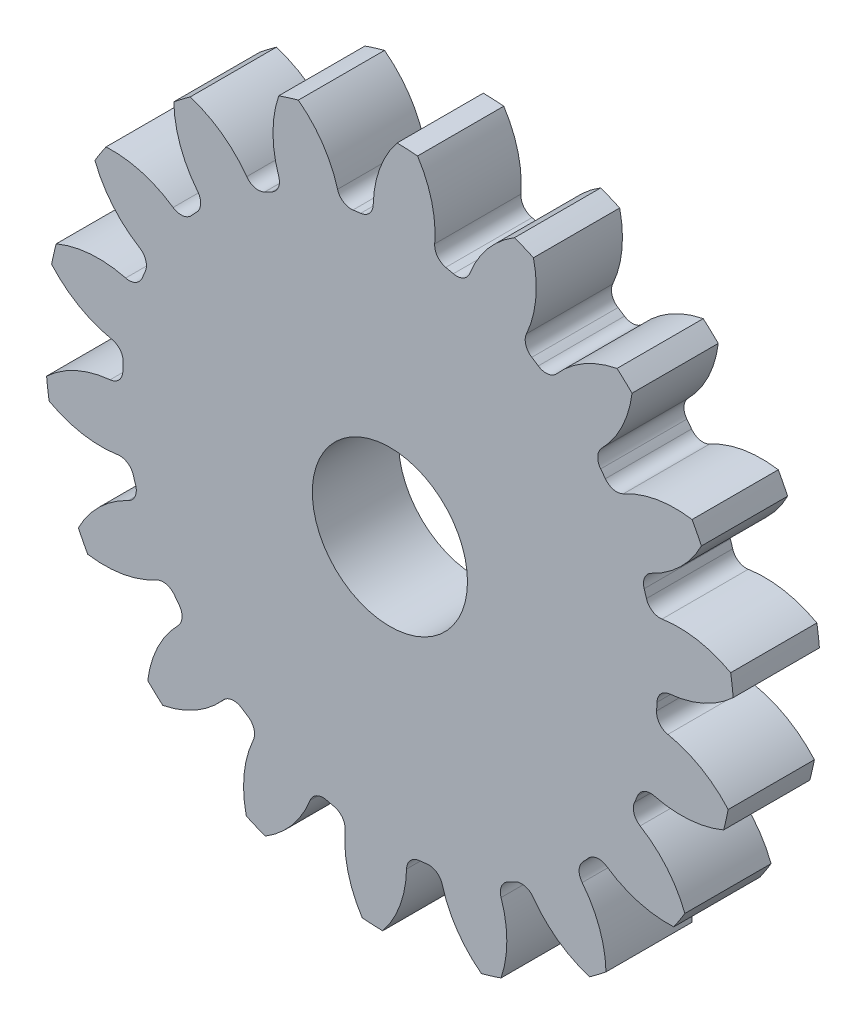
from build123d import *

# Parameters (mm, degrees)
SKETCH3_R         = 508
GEARBODY_DEPTH    = 127
TOOTHCUT_DEPTH    = 730.55945611
CIRPATTERN1_COUNT = 18
BOREDIA_R         = 114.3
BORE_DEPTH        = 12700


with BuildPart() as part:
    # Sketch3 → gearBody (new body)
    with BuildSketch(Plane.XY):
        Circle(SKETCH3_R)
    extrude(amount=GEARBODY_DEPTH)

    # Sketch2 → toothCut (cut, through all)
    with BuildSketch(Plane.XY):
        with BuildLine():
            ThreePointArc((392.865427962, -25.621192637), (393.195707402, -19.920483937), (393.443270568, -14.21558458))
            ThreePointArc((393.443270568, -14.21558458), (399.057984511, -0.782707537), (412.133989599, 5.619267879))
            ThreePointArc((412.133989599, 5.619267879), (463.839355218, 19.605943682), (508, 49.919461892))
            ThreePointArc((508, 49.919461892), (509.792982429, -25.827654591), (500.353674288, -101.005709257))
            ThreePointArc((500.353674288, -101.005709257), (459.482832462, -66.384238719), (409.455802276, -47.243492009))
            ThreePointArc((409.455802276, -47.243492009), (397.093776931, -39.552749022), (392.865427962, -25.621192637))
        make_face()
    toothcut = extrude(amount=TOOTHCUT_DEPTH, mode=Mode.SUBTRACT)

    # CirPattern1: toothCut ×18 about axis
    cirpattern1_axis = Axis((0, 0, 0), (0, 0, 1))
    for i in range(1, CIRPATTERN1_COUNT):
        add(toothcut.rotate(cirpattern1_axis, i * 360 / CIRPATTERN1_COUNT), mode=Mode.SUBTRACT)

    # boreDia → bore (cut, symmetric)
    with BuildSketch(Plane.XY):
        Circle(BOREDIA_R)
    extrude(amount=BORE_DEPTH, both=True, mode=Mode.SUBTRACT)


solid = part.part
